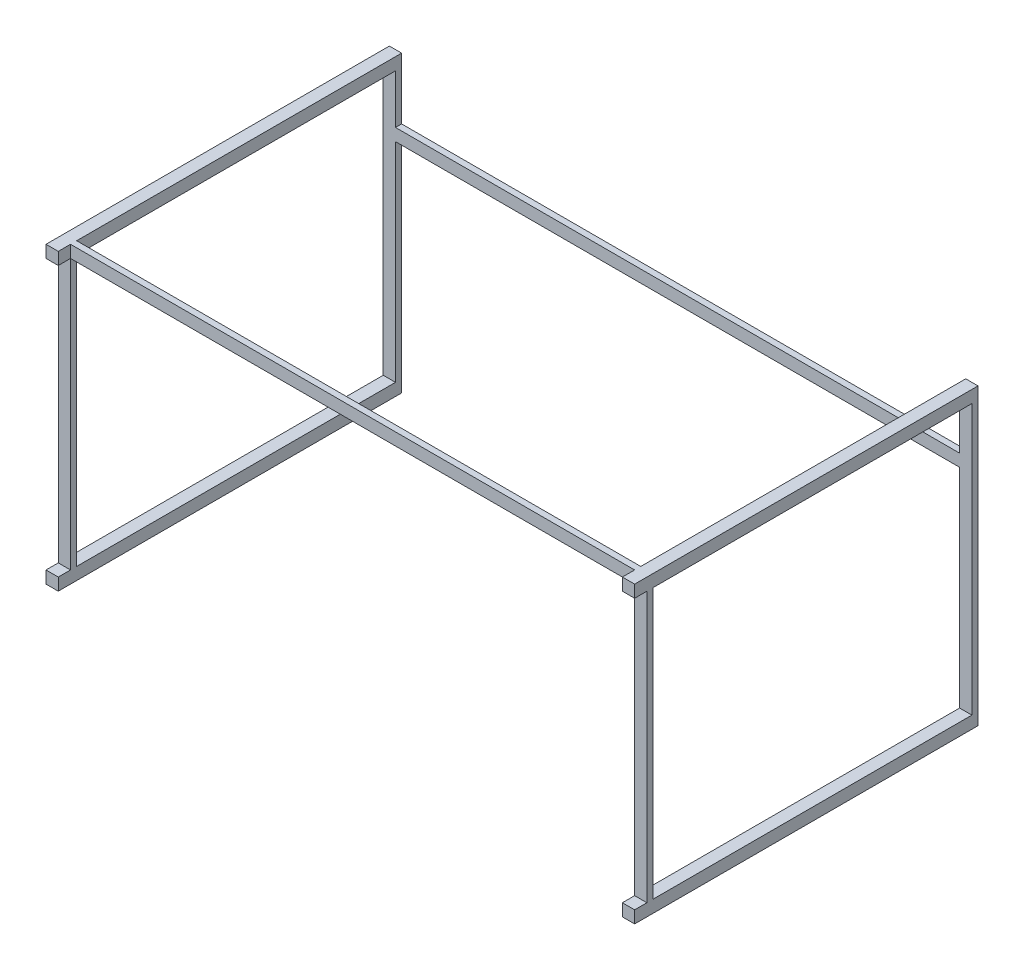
from build123d import *

# Parameters (mm, degrees)
SKETCH1_W           = 25.4
SKETCH1_H           = 25.4
BOSS_EXTRUDE1_DEPTH = 711.2
SKETCH3_W           = 25.4
SKETCH3_H           = 12.7
BOSS_EXTRUDE2_DEPTH = 558.8
BOSS_EXTRUDE3_START = -685.8
SKETCH4_W           = 25.4
SKETCH4_H           = 25.4
BOSS_EXTRUDE3_DEPTH = 711.2
SKETCH6_W           = 12.7
SKETCH6_H           = 25.4
BOSS_EXTRUDE4_DEPTH = 584.2
BOSS_EXTRUDE6_REACH = 1529.594
SKETCH10_W          = 25.4
SKETCH10_H          = 12.7
BOSS_EXTRUDE7_REACH = 1509.4
SKETCH13_W          = 12.7
SKETCH13_H          = 25.4


with BuildPart() as part:
    # Sketch1 → Boss-Extrude1 (new body)
    with BuildSketch(Plane.XY):
        with Locations((12.7, 12.7)):
            Rectangle(SKETCH1_W, SKETCH1_H)
    boss_extrude1 = extrude(amount=-BOSS_EXTRUDE1_DEPTH)

    # Sketch3 → Boss-Extrude2 (add)
    with BuildSketch(Plane.XZ):
        with Locations((12.7, -31.75)):
            Rectangle(SKETCH3_W, SKETCH3_H)
    boss_extrude2 = extrude(amount=BOSS_EXTRUDE2_DEPTH)

    # Sketch4 → Boss-Extrude3 (add)
    with BuildSketch(Plane.XY.offset(-25.4).offset(BOSS_EXTRUDE3_START)):
        with Locations((12.7, -571.5)):
            Rectangle(SKETCH4_W, SKETCH4_H)
    boss_extrude3 = extrude(amount=BOSS_EXTRUDE3_DEPTH)

    # Sketch6 → Boss-Extrude4 (add)
    with BuildSketch(Plane(origin=(25.4, 0, 0), x_dir=(0, 0, -1), z_dir=(1, 0, 0))):
        with Locations((31.75, 12.7)):
            Rectangle(SKETCH6_W, SKETCH6_H)
    boss_extrude4 = extrude(amount=BOSS_EXTRUDE4_DEPTH)

    # Mirror2: Boss-Extrude4 across plane
    add(boss_extrude4.mirror(Plane(origin=(609.6, 0, 0), x_dir=(0, 0, 1), z_dir=(1, 0, 0))))

    # Mirror3: Boss-Extrude1, Boss-Extrude2, Boss-Extrude3 across plane
    add(boss_extrude1.mirror(Plane(origin=(609.6, 0, 0), x_dir=(0, 0, 1), z_dir=(1, 0, 0))))
    add(boss_extrude2.mirror(Plane(origin=(609.6, 0, 0), x_dir=(0, 0, 1), z_dir=(1, 0, 0))))
    add(boss_extrude3.mirror(Plane(origin=(609.6, 0, 0), x_dir=(0, 0, 1), z_dir=(1, 0, 0))))

    # Sketch10 → Boss-Extrude6 (add, up to next)
    with BuildSketch(Plane.XZ, mode=Mode.PRIVATE) as boss_extrude6_sk1:
        with Locations((12.7, -704.85)):
            Rectangle(SKETCH10_W, SKETCH10_H)
    boss_extrude6_tool1 = extrude(boss_extrude6_sk1.sketch, amount=BOSS_EXTRUDE6_REACH, mode=Mode.PRIVATE) - part.part
    boss_extrude6 = boss_extrude6_tool1.solids().sort_by_distance((12.7, 0, -704.85))[0]
    add(boss_extrude6)

    # Mirror4: Boss-Extrude6 across plane
    add(boss_extrude6.mirror(Plane(origin=(609.6, 0, 0), x_dir=(0, 0, 1), z_dir=(1, 0, 0))))

    # Sketch13 → Boss-Extrude7 (add, up to next)
    with BuildSketch(Plane(origin=(25.4, 0, 0), x_dir=(0, 0, -1), z_dir=(1, 0, 0)), mode=Mode.PRIVATE) as boss_extrude7_sk1:
        with Locations((704.85, -114.3)):
            Rectangle(SKETCH13_W, SKETCH13_H)
    boss_extrude7_tool1 = extrude(boss_extrude7_sk1.sketch, amount=BOSS_EXTRUDE7_REACH, mode=Mode.PRIVATE) - part.part
    add(boss_extrude7_tool1.solids().sort_by_distance((25.4, -114.3, -704.85))[0])


solid = part.part
